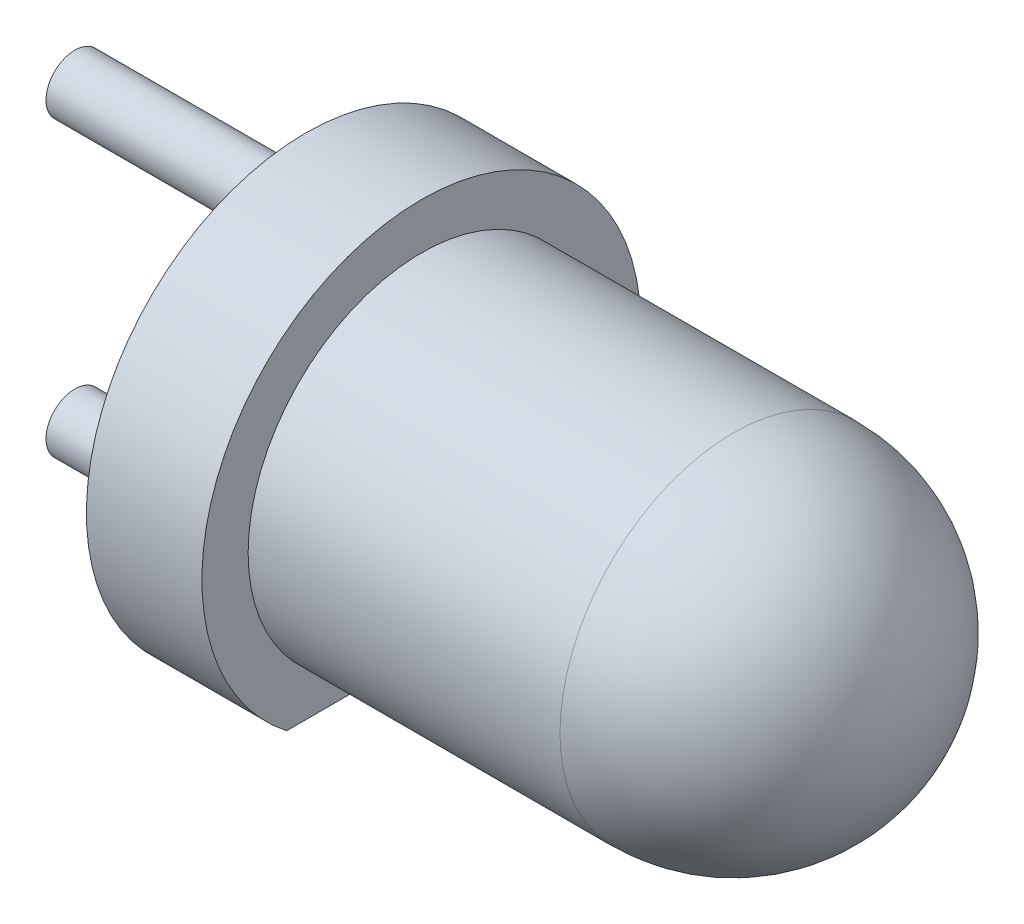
from build123d import *

# Parameters (mm, degrees)
ESQUISSE2_R             = 0.25
EXTRUSION1_DEPTH        = 2
ESQUISSE3_W             = 3.802685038
ESQUISSE3_H             = 0.717288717
ENL_V_MAT_EXTRU_1_DEPTH = 10


with BuildPart() as part:
    # Esquisse1 → R_volution1 (revolve)
    with BuildSketch(Plane.XY, mode=Mode.PRIVATE) as r_volution1_sk:
        with BuildLine():
            Line((0, 0), (4.2, 0))
            ThreePointArc((4.2, 0), (3.760660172, 1.060660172), (2.7, 1.5))
            Line((2.7, 1.5), (0, 1.5))
            Line((0, 1.5), (0, 1.9))
            Line((0, 1.9), (-1, 1.9))
            Line((-1, 1.9), (-1, 0))
            Line((-1, 0), (0, 0))
        make_face()
    revolve(r_volution1_sk.sketch.rotate(Axis((0, 0, 0), (1, 0, 0)), 90), axis=Axis((0, 0, 0), (1, 0, 0)))

    # Esquisse2 → Extrusion1 (add)
    with BuildSketch(Plane.ZY.offset(1)):
        with Locations(Location((0, 1.27, 0), (0, 0, 180))):
            Circle(ESQUISSE2_R)
        with Locations(Location((0, -1.27, 0), (0, 0, 180))):
            Circle(ESQUISSE2_R)
    extrude(amount=EXTRUSION1_DEPTH)

    # Esquisse3 → Enl_v. mat.-Extru.1 (cut)
    with BuildSketch(Plane.ZY.offset(1)):
        with Locations((0.034282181, -1.858644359)):
            Rectangle(ESQUISSE3_W, ESQUISSE3_H)
    extrude(amount=-ENL_V_MAT_EXTRU_1_DEPTH, mode=Mode.SUBTRACT)


solid = part.part
